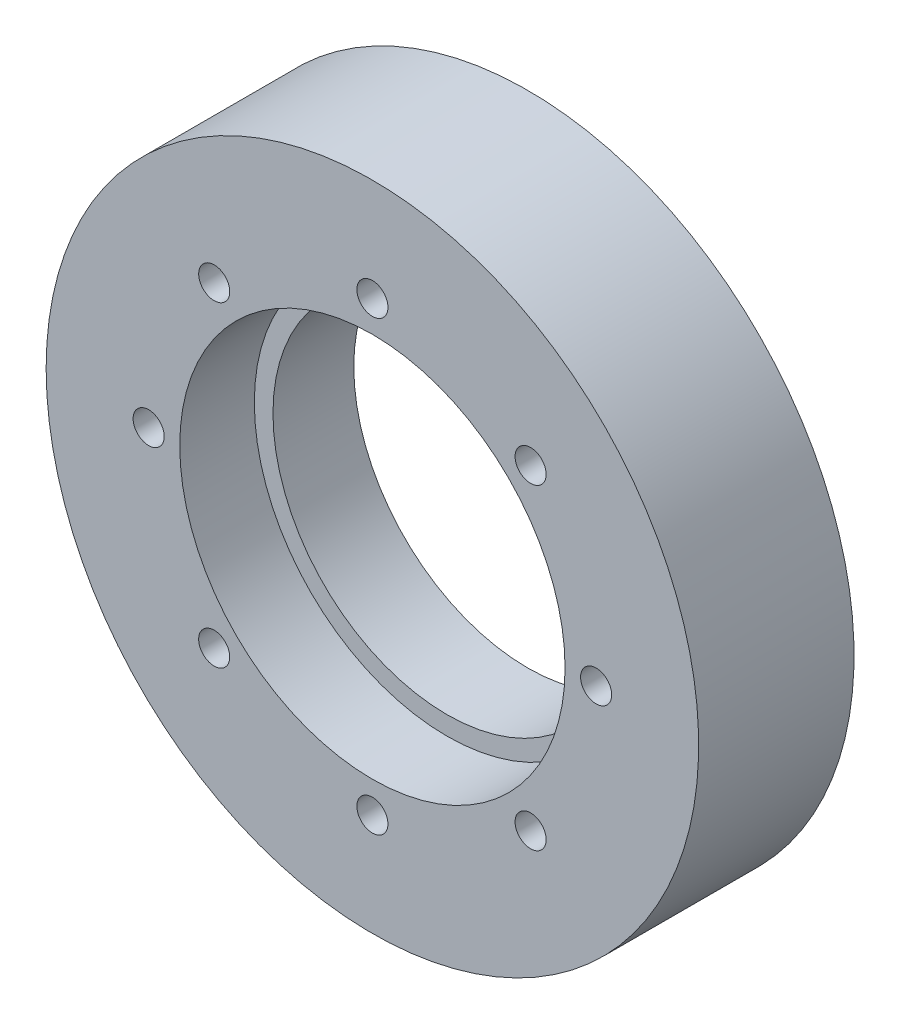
from build123d import *

# Parameters (mm, degrees)
SKETCH1_W           = 40
SKETCH1_H           = 25
SKETCH5_R           = 31
CUT_EXTRUDE2_DEPTH  = 30
SKETCH6_R           = 2.5
CUT_EXTRUDE3_DEPTH  = 30
SKETCH7_R           = 31
SKETCH7_R_2         = 28
BOSS_EXTRUDE1_DEPTH = 13


with BuildPart() as part:
    # Sketch1 → Revolve1 (revolve)
    with BuildSketch(Plane(origin=(0, 0, 0), x_dir=(1, 0, 0), z_dir=(0, 1, 0)), mode=Mode.PRIVATE) as revolve1_sk:
        with BuildLine():
            Line((52.5, 12.5), (40, 12.5))
            ThreePointArc((40, 12.5), (48.838834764, 8.838834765), (52.5, 1e-09))
            Line((52.5, 1e-09), (52.5, 12.5))
        make_face()
        with BuildLine():
            ThreePointArc((52.5, 1e-09), (48.838834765, -8.838834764), (40, -12.5))
            Line((40, -12.5), (52.5, -12.5))
            Line((52.5, -12.5), (52.5, 1e-09))
        make_face()
        with BuildLine():
            Line((40, 12.5), (40, -12.5))
            ThreePointArc((40, -12.5), (52.5, 0), (40, 12.5))
        make_face()
        with Locations((20, 0)):
            Rectangle(SKETCH1_W, SKETCH1_H)
    revolve(revolve1_sk.sketch.rotate(Axis((0, 0, -12.5), (0, 0, 1)), 180), axis=Axis((0, 0, -12.5), (0, 0, 1)))

    # Sketch5 → Cut-Extrude2 (cut)
    with BuildSketch(Plane(origin=(0, 0, -12.5), x_dir=(-1, 0, 0), z_dir=(0, 0, -1))):
        Circle(SKETCH5_R)
    extrude(amount=-CUT_EXTRUDE2_DEPTH, mode=Mode.SUBTRACT)

    # Sketch6 → Cut-Extrude3 (cut)
    with BuildSketch(Plane(origin=(0, 0, -12.5), x_dir=(-1, 0, 0), z_dir=(0, 0, -1))):
        with Locations((36, 0)):
            Circle(SKETCH6_R)
        with Locations((25.455844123, -25.455844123)):
            Circle(SKETCH6_R)
        with Locations((0, -36)):
            Circle(SKETCH6_R)
        with Locations((-25.455844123, -25.455844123)):
            Circle(SKETCH6_R)
        with Locations((-36, 0)):
            Circle(SKETCH6_R)
        with Locations((-25.455844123, 25.455844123)):
            Circle(SKETCH6_R)
        with Locations((0, 36)):
            Circle(SKETCH6_R)
        with Locations((25.455844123, 25.455844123)):
            Circle(SKETCH6_R)
    extrude(amount=-CUT_EXTRUDE3_DEPTH, mode=Mode.SUBTRACT)

    # Sketch7 → Boss-Extrude1 (add)
    with BuildSketch(Plane(origin=(0, 0, -12.5), x_dir=(-1, 0, 0), z_dir=(0, 0, -1))):
        Circle(SKETCH7_R)
        Circle(SKETCH7_R_2, mode=Mode.SUBTRACT)
    extrude(amount=-BOSS_EXTRUDE1_DEPTH)


solid = part.part
